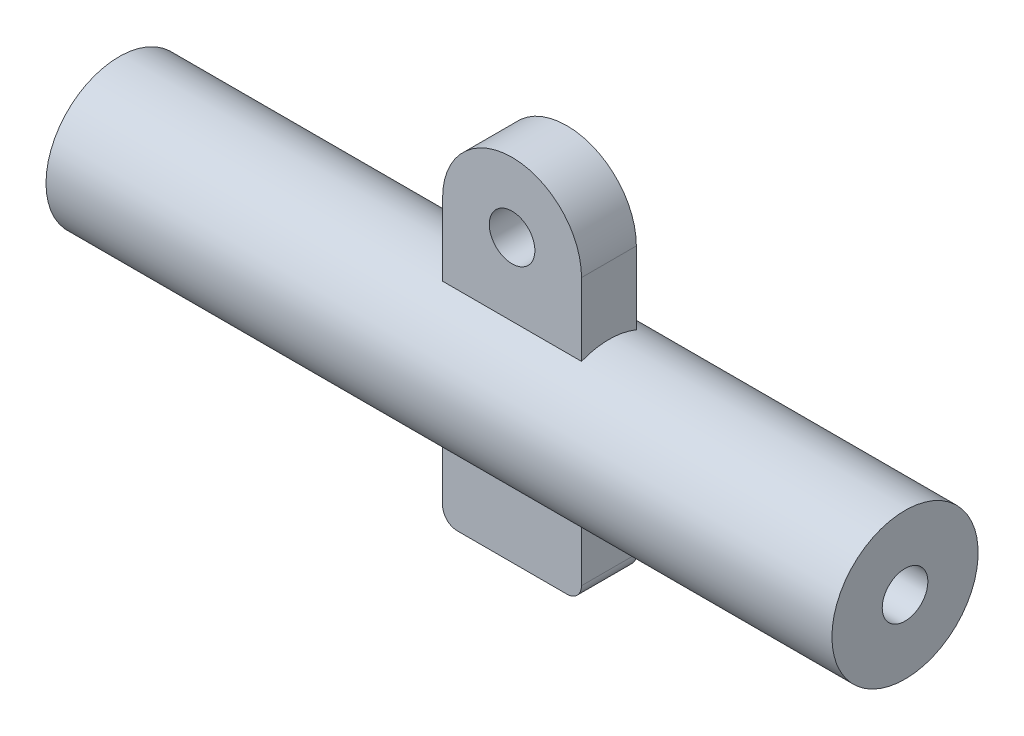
from build123d import *

# Parameters (mm, degrees)
SKETCH2_W           = 136.525
SKETCH2_H           = 8.7376
SKETCH3_R           = 3.9624
BOSS_EXTRUDE1_DEPTH = 4.7625
FILLET1_R           = 2.54


with BuildPart() as part:
    # Sketch2 → Revolve1 (revolve)
    with BuildSketch(Plane.XY, mode=Mode.PRIVATE) as revolve1_sk:
        with Locations((68.2625, 8.3312)):
            Rectangle(SKETCH2_W, SKETCH2_H)
    revolve(revolve1_sk.sketch.rotate(Axis((0, 0, 0), (1, 0, 0)), 90), axis=Axis((0, 0, 0), (1, 0, 0)))

    # Sketch3 → Boss-Extrude1 (add, symmetric)
    with BuildSketch(Plane.XY):
        with BuildLine():
            Line((60.96, -24.511), (85.09, -24.511))
            Line((85.09, -24.511), (85.09, 24.384))
            ThreePointArc((85.09, 24.384), (73.025, 36.449), (60.96, 24.384))
            Line((60.96, 24.384), (60.96, -24.511))
        make_face()
        with Locations(Location((73.025, 24.384, 0), (0, 0, 180))):
            Circle(SKETCH3_R, mode=Mode.SUBTRACT)
    extrude(amount=BOSS_EXTRUDE1_DEPTH, both=True)

    # Fillet1
    fillet1_edges = [part.edges().sort_by_distance(p)[0] for p in [
        (85.09, -24.511, 0),
        (60.96, -24.511, 0),
    ]]
    fillet(fillet1_edges, radius=FILLET1_R)


solid = part.part
